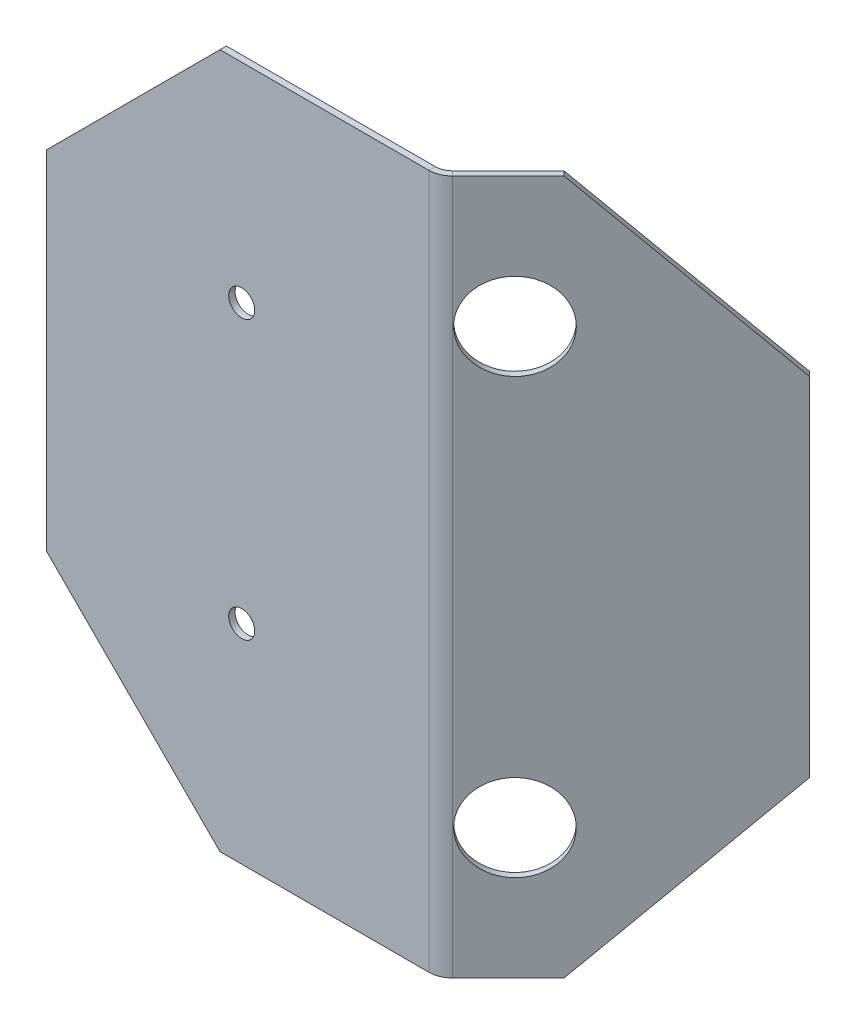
ISO-10303-21;
HEADER;
FILE_DESCRIPTION(('STEP AP214'),'2;1');
FILE_NAME('part.step','',(''),(''),'','','');
FILE_SCHEMA(('AUTOMOTIVE_DESIGN { 1 0 10303 214 1 1 1 1 }'));
ENDSEC;
DATA;
#1=APPLICATION_CONTEXT('core data for automotive mechanical design processes');
#2=APPLICATION_PROTOCOL_DEFINITION('international standard','automotive_design',2000,#1);
#3=PRODUCT_CONTEXT('',#1,'mechanical');
#4=PRODUCT('Part','Part','',(#3));
#5=PRODUCT_RELATED_PRODUCT_CATEGORY('part','',(#4));
#6=PRODUCT_DEFINITION_FORMATION('','',#4);
#7=PRODUCT_DEFINITION_CONTEXT('part definition',#1,'design');
#8=PRODUCT_DEFINITION('design','',#6,#7);
#9=PRODUCT_DEFINITION_SHAPE('','',#8);
#10=(LENGTH_UNIT() NAMED_UNIT(*) SI_UNIT(.MILLI.,.METRE.));
#11=(NAMED_UNIT(*) PLANE_ANGLE_UNIT() SI_UNIT($,.RADIAN.));
#12=(NAMED_UNIT(*) SI_UNIT($,.STERADIAN.) SOLID_ANGLE_UNIT());
#13=UNCERTAINTY_MEASURE_WITH_UNIT(LENGTH_MEASURE(1.E-05),#10,'distance_accuracy_value','');
#14=(GEOMETRIC_REPRESENTATION_CONTEXT(3) GLOBAL_UNCERTAINTY_ASSIGNED_CONTEXT((#13)) GLOBAL_UNIT_ASSIGNED_CONTEXT((#10,
#11,#12)) REPRESENTATION_CONTEXT('',''));
#15=CARTESIAN_POINT('',(0.,0.,0.));
#16=DIRECTION('',(0.,0.,1.));
#17=DIRECTION('',(1.,0.,0.));
#18=AXIS2_PLACEMENT_3D('',#15,#16,#17);
#19=CARTESIAN_POINT('',(21.5606126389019,-40.,-20.6205050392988));
#20=DIRECTION('',(0.707106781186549,0.,0.707106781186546));
#21=DIRECTION('',(0.707106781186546,0.,-0.707106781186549));
#22=AXIS2_PLACEMENT_3D('',#19,#20,#21);
#23=PLANE('',#22);
#24=CARTESIAN_POINT('',(4.59004989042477,25.,-3.64994229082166));
#25=DIRECTION('',(0.707106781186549,0.,0.707106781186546));
#26=DIRECTION('',(0.707106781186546,0.,-0.707106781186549));
#27=AXIS2_PLACEMENT_3D('',#24,#25,#26);
#28=CIRCLE('',#27,5.);
#29=CARTESIAN_POINT('',(8.1255837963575,25.,-7.1854761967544));
#30=VERTEX_POINT('',#29);
#31=EDGE_CURVE('E178',#30,#30,#28,.T.);
#32=ORIENTED_EDGE('',*,*,#31,.F.);
#33=EDGE_LOOP('',(#32));
#34=FACE_BOUND('',#33,.T.);
#35=CARTESIAN_POINT('',(4.59004989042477,-25.,-3.64994229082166));
#36=DIRECTION('',(0.707106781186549,0.,0.707106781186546));
#37=DIRECTION('',(-0.707106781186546,0.,0.707106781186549));
#38=AXIS2_PLACEMENT_3D('',#35,#36,#37);
#39=CIRCLE('',#38,5.);
#40=CARTESIAN_POINT('',(1.05451598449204,-25.,-0.114408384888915));
#41=VERTEX_POINT('',#40);
#42=EDGE_CURVE('E172',#41,#41,#39,.T.);
#43=ORIENTED_EDGE('',*,*,#42,.F.);
#44=EDGE_LOOP('',(#43));
#45=FACE_BOUND('',#44,.T.);
#46=DIRECTION('',(-0.707106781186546,0.,0.707106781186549));
#47=VECTOR('',#46,1.);
#48=CARTESIAN_POINT('',(-17.3302603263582,40.,18.2703679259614));
#49=LINE('',#48,#47);
#50=CARTESIAN_POINT('',(7.41847701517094,40.,-6.47836941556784));
#51=VERTEX_POINT('',#50);
#52=CARTESIAN_POINT('',(1.00503918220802,40.,-0.0649315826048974));
#53=VERTEX_POINT('',#52);
#54=EDGE_CURVE('E49',#51,#53,#49,.T.);
#55=ORIENTED_EDGE('',*,*,#54,.T.);
#56=DIRECTION('',(0.,-1.,0.));
#57=VECTOR('',#56,1.);
#58=CARTESIAN_POINT('',(1.00503918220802,-40.,-0.0649315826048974));
#59=LINE('',#58,#57);
#60=CARTESIAN_POINT('',(1.00503918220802,-40.,-0.0649315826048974));
#61=VERTEX_POINT('',#60);
#62=EDGE_CURVE('E41',#53,#61,#59,.T.);
#63=ORIENTED_EDGE('',*,*,#62,.T.);
#64=DIRECTION('',(0.707106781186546,0.,-0.707106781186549));
#65=VECTOR('',#64,1.);
#66=CARTESIAN_POINT('',(-31.4723959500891,-40.,32.4125035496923));
#67=LINE('',#66,#65);
#68=CARTESIAN_POINT('',(7.41847701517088,-40.,-6.47836941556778));
#69=VERTEX_POINT('',#68);
#70=EDGE_CURVE('E57',#61,#69,#67,.T.);
#71=ORIENTED_EDGE('',*,*,#70,.T.);
#72=DIRECTION('',(-0.5,-0.707106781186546,0.500000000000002));
#73=VECTOR('',#72,1.);
#74=CARTESIAN_POINT('',(14.4895448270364,-30.,-13.5494372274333));
#75=LINE('',#74,#73);
#76=CARTESIAN_POINT('',(21.5606126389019,-20.,-20.6205050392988));
#77=VERTEX_POINT('',#76);
#78=EDGE_CURVE('E197',#69,#77,#75,.F.);
#79=ORIENTED_EDGE('',*,*,#78,.T.);
#80=DIRECTION('',(0.,1.,0.));
#81=VECTOR('',#80,1.);
#82=CARTESIAN_POINT('',(21.5606126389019,40.,-20.6205050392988));
#83=LINE('',#82,#81);
#84=CARTESIAN_POINT('',(21.5606126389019,19.9999999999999,-20.6205050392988));
#85=VERTEX_POINT('',#84);
#86=EDGE_CURVE('E185',#77,#85,#83,.T.);
#87=ORIENTED_EDGE('',*,*,#86,.T.);
#88=DIRECTION('',(0.499999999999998,-0.707106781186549,-0.5));
#89=VECTOR('',#88,1.);
#90=CARTESIAN_POINT('',(42.7738160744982,-10.0000000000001,-41.8337084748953));
#91=LINE('',#90,#89);
#92=EDGE_CURVE('E195',#85,#51,#91,.F.);
#93=ORIENTED_EDGE('',*,*,#92,.T.);
#94=EDGE_LOOP('',(#55,#63,#71,#79,#87,#93));
#95=FACE_BOUND('',#94,.T.);
#96=ADVANCED_FACE('F32',(#34,#45,#95),#23,.T.);
#97=CARTESIAN_POINT('',(21.0397577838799,-40.,-21.1413598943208));
#98=DIRECTION('',(0.707106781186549,0.,0.707106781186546));
#99=DIRECTION('',(0.707106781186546,0.,-0.707106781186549));
#100=AXIS2_PLACEMENT_3D('',#97,#98,#99);
#101=PLANE('',#100);
#102=DIRECTION('',(0.,-1.,0.));
#103=VECTOR('',#102,1.);
#104=CARTESIAN_POINT('',(0.484184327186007,-40.,-0.585786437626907));
#105=LINE('',#104,#103);
#106=CARTESIAN_POINT('',(0.484184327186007,40.,-0.585786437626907));
#107=VERTEX_POINT('',#106);
#108=CARTESIAN_POINT('',(0.484184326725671,-40.,-0.585786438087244));
#109=VERTEX_POINT('',#108);
#110=EDGE_CURVE('E207',#107,#109,#105,.T.);
#111=ORIENTED_EDGE('',*,*,#110,.F.);
#112=DIRECTION('',(-0.707106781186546,0.,0.707106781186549));
#113=VECTOR('',#112,1.);
#114=CARTESIAN_POINT('',(-17.8511151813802,40.,17.7495130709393));
#115=LINE('',#114,#113);
#116=CARTESIAN_POINT('',(6.89762216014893,40.,-6.99922427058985));
#117=VERTEX_POINT('',#116);
#118=EDGE_CURVE('E184',#117,#107,#115,.T.);
#119=ORIENTED_EDGE('',*,*,#118,.F.);
#120=DIRECTION('',(-0.499999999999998,0.707106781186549,0.5));
#121=VECTOR('',#120,1.);
#122=CARTESIAN_POINT('',(6.89762216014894,40.,-6.99922427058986));
#123=LINE('',#122,#121);
#124=CARTESIAN_POINT('',(21.0397577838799,19.9999999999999,-21.1413598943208));
#125=VERTEX_POINT('',#124);
#126=EDGE_CURVE('E190',#117,#125,#123,.F.);
#127=ORIENTED_EDGE('',*,*,#126,.T.);
#128=DIRECTION('',(0.,1.,0.));
#129=VECTOR('',#128,1.);
#130=CARTESIAN_POINT('',(21.0397577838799,40.,-21.1413598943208));
#131=LINE('',#130,#129);
#132=CARTESIAN_POINT('',(21.0397577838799,-20.,-21.1413598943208));
#133=VERTEX_POINT('',#132);
#134=EDGE_CURVE('E181',#133,#125,#131,.T.);
#135=ORIENTED_EDGE('',*,*,#134,.F.);
#136=DIRECTION('',(0.5,0.707106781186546,-0.500000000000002));
#137=VECTOR('',#136,1.);
#138=CARTESIAN_POINT('',(21.0397577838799,-20.,-21.1413598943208));
#139=LINE('',#138,#137);
#140=CARTESIAN_POINT('',(6.89762216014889,-40.,-6.99922427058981));
#141=VERTEX_POINT('',#140);
#142=EDGE_CURVE('E192',#133,#141,#139,.F.);
#143=ORIENTED_EDGE('',*,*,#142,.T.);
#144=DIRECTION('',(0.707106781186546,0.,-0.707106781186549));
#145=VECTOR('',#144,1.);
#146=CARTESIAN_POINT('',(-17.8511151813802,-40.,17.7495130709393));
#147=LINE('',#146,#145);
#148=EDGE_CURVE('E36',#109,#141,#147,.T.);
#149=ORIENTED_EDGE('',*,*,#148,.F.);
#150=EDGE_LOOP('',(#111,#119,#127,#135,#143,#149));
#151=FACE_BOUND('',#150,.T.);
#152=CARTESIAN_POINT('',(4.06919503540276,25.,-4.17079714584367));
#153=DIRECTION('',(0.707106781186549,0.,0.707106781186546));
#154=DIRECTION('',(0.707106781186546,0.,-0.707106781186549));
#155=AXIS2_PLACEMENT_3D('',#152,#153,#154);
#156=CIRCLE('',#155,5.);
#157=CARTESIAN_POINT('',(7.60472894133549,25.,-7.70633105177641));
#158=VERTEX_POINT('',#157);
#159=EDGE_CURVE('E175',#158,#158,#156,.T.);
#160=ORIENTED_EDGE('',*,*,#159,.T.);
#161=EDGE_LOOP('',(#160));
#162=FACE_BOUND('',#161,.T.);
#163=CARTESIAN_POINT('',(4.06919503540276,-25.,-4.17079714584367));
#164=DIRECTION('',(0.707106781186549,0.,0.707106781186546));
#165=DIRECTION('',(-0.707106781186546,0.,0.707106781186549));
#166=AXIS2_PLACEMENT_3D('',#163,#164,#165);
#167=CIRCLE('',#166,5.);
#168=CARTESIAN_POINT('',(0.533661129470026,-25.,-0.635263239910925));
#169=VERTEX_POINT('',#168);
#170=EDGE_CURVE('E169',#169,#169,#167,.T.);
#171=ORIENTED_EDGE('',*,*,#170,.T.);
#172=EDGE_LOOP('',(#171));
#173=FACE_BOUND('',#172,.T.);
#174=ADVANCED_FACE('F229',(#151,#162,#173),#101,.F.);
#175=CARTESIAN_POINT('',(21.5606126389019,40.,-20.6205050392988));
#176=DIRECTION('',(-0.707106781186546,0.,0.707106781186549));
#177=DIRECTION('',(0.707106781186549,0.,0.707106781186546));
#178=AXIS2_PLACEMENT_3D('',#175,#176,#177);
#179=PLANE('',#178);
#180=ORIENTED_EDGE('',*,*,#86,.F.);
#181=DIRECTION('',(-0.707106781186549,0.,-0.707106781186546));
#182=VECTOR('',#181,1.);
#183=CARTESIAN_POINT('',(21.5606126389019,-20.,-20.6205050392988));
#184=LINE('',#183,#182);
#185=EDGE_CURVE('E204',#77,#133,#184,.T.);
#186=ORIENTED_EDGE('',*,*,#185,.T.);
#187=ORIENTED_EDGE('',*,*,#134,.T.);
#188=DIRECTION('',(0.707106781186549,0.,0.707106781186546));
#189=VECTOR('',#188,1.);
#190=CARTESIAN_POINT('',(21.5606126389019,19.9999999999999,-20.6205050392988));
#191=LINE('',#190,#189);
#192=EDGE_CURVE('E202',#125,#85,#191,.T.);
#193=ORIENTED_EDGE('',*,*,#192,.T.);
#194=EDGE_LOOP('',(#180,#186,#187,#193));
#195=FACE_BOUND('',#194,.T.);
#196=ADVANCED_FACE('F226',(#195),#179,.F.);
#197=CARTESIAN_POINT('',(-17.3302603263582,40.,18.2703679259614));
#198=DIRECTION('',(0.,-1.,0.));
#199=DIRECTION('',(-0.707106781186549,0.,-0.707106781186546));
#200=AXIS2_PLACEMENT_3D('',#197,#198,#199);
#201=PLANE('',#200);
#202=DIRECTION('',(-0.707106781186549,0.,-0.707106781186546));
#203=VECTOR('',#202,1.);
#204=CARTESIAN_POINT('',(1.00503918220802,40.,-0.0649315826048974));
#205=LINE('',#204,#203);
#206=EDGE_CURVE('E12',#53,#107,#205,.T.);
#207=ORIENTED_EDGE('',*,*,#206,.F.);
#208=ORIENTED_EDGE('',*,*,#54,.F.);
#209=DIRECTION('',(-0.707106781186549,0.,-0.707106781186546));
#210=VECTOR('',#209,1.);
#211=CARTESIAN_POINT('',(7.41847701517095,40.,-6.47836941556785));
#212=LINE('',#211,#210);
#213=EDGE_CURVE('E199',#51,#117,#212,.T.);
#214=ORIENTED_EDGE('',*,*,#213,.T.);
#215=ORIENTED_EDGE('',*,*,#118,.T.);
#216=EDGE_LOOP('',(#207,#208,#214,#215));
#217=FACE_BOUND('',#216,.T.);
#218=ADVANCED_FACE('F34',(#217),#201,.F.);
#219=CARTESIAN_POINT('',(-17.3302603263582,-40.,18.2703679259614));
#220=DIRECTION('',(0.,1.,0.));
#221=DIRECTION('',(0.707106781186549,0.,0.707106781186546));
#222=AXIS2_PLACEMENT_3D('',#219,#220,#221);
#223=PLANE('',#222);
#224=DIRECTION('',(0.707106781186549,0.,0.707106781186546));
#225=VECTOR('',#224,1.);
#226=CARTESIAN_POINT('',(1.00503918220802,-40.,-0.0649315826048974));
#227=LINE('',#226,#225);
#228=EDGE_CURVE('E210',#109,#61,#227,.T.);
#229=ORIENTED_EDGE('',*,*,#228,.F.);
#230=ORIENTED_EDGE('',*,*,#148,.T.);
#231=DIRECTION('',(0.707106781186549,0.,0.707106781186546));
#232=VECTOR('',#231,1.);
#233=CARTESIAN_POINT('',(7.4184770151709,-40.,-6.4783694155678));
#234=LINE('',#233,#232);
#235=EDGE_CURVE('E188',#141,#69,#234,.T.);
#236=ORIENTED_EDGE('',*,*,#235,.T.);
#237=ORIENTED_EDGE('',*,*,#70,.F.);
#238=EDGE_LOOP('',(#229,#230,#236,#237));
#239=FACE_BOUND('',#238,.T.);
#240=ADVANCED_FACE('F219',(#239),#223,.F.);
#241=CARTESIAN_POINT('',(4.59004989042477,25.,-3.64994229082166));
#242=DIRECTION('',(-0.707106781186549,0.,-0.707106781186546));
#243=DIRECTION('',(-0.707106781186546,0.,0.707106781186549));
#244=AXIS2_PLACEMENT_3D('',#241,#242,#243);
#245=CYLINDRICAL_SURFACE('',#244,5.);
#246=ORIENTED_EDGE('',*,*,#31,.T.);
#247=EDGE_LOOP('',(#246));
#248=FACE_BOUND('',#247,.T.);
#249=ORIENTED_EDGE('',*,*,#159,.F.);
#250=EDGE_LOOP('',(#249));
#251=FACE_BOUND('',#250,.T.);
#252=ADVANCED_FACE('F318',(#248,#251),#245,.F.);
#253=CARTESIAN_POINT('',(4.59004989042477,-25.,-3.64994229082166));
#254=DIRECTION('',(-0.707106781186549,0.,-0.707106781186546));
#255=DIRECTION('',(-0.707106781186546,0.,0.707106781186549));
#256=AXIS2_PLACEMENT_3D('',#253,#254,#255);
#257=CYLINDRICAL_SURFACE('',#256,5.);
#258=ORIENTED_EDGE('',*,*,#42,.T.);
#259=EDGE_LOOP('',(#258));
#260=FACE_BOUND('',#259,.T.);
#261=ORIENTED_EDGE('',*,*,#170,.F.);
#262=EDGE_LOOP('',(#261));
#263=FACE_BOUND('',#262,.T.);
#264=ADVANCED_FACE('F324',(#260,#263),#257,.F.);
#265=CARTESIAN_POINT('',(21.5606126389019,-20.,-20.6205050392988));
#266=DIRECTION('',(-0.499999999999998,0.707106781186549,0.5));
#267=DIRECTION('',(-0.5,-0.707106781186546,0.500000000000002));
#268=AXIS2_PLACEMENT_3D('',#265,#266,#267);
#269=PLANE('',#268);
#270=ORIENTED_EDGE('',*,*,#78,.F.);
#271=ORIENTED_EDGE('',*,*,#235,.F.);
#272=ORIENTED_EDGE('',*,*,#142,.F.);
#273=ORIENTED_EDGE('',*,*,#185,.F.);
#274=EDGE_LOOP('',(#270,#271,#272,#273));
#275=FACE_BOUND('',#274,.T.);
#276=ADVANCED_FACE('F223',(#275),#269,.F.);
#277=CARTESIAN_POINT('',(7.41847701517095,40.,-6.47836941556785));
#278=DIRECTION('',(-0.5,-0.707106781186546,0.500000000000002));
#279=DIRECTION('',(0.499999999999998,-0.707106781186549,-0.5));
#280=AXIS2_PLACEMENT_3D('',#277,#278,#279);
#281=PLANE('',#280);
#282=ORIENTED_EDGE('',*,*,#92,.F.);
#283=ORIENTED_EDGE('',*,*,#192,.F.);
#284=ORIENTED_EDGE('',*,*,#126,.F.);
#285=ORIENTED_EDGE('',*,*,#213,.F.);
#286=EDGE_LOOP('',(#282,#283,#284,#285));
#287=FACE_BOUND('',#286,.T.);
#288=ADVANCED_FACE('F235',(#287),#281,.F.);
#289=CARTESIAN_POINT('',(-45.,20.,0.7366));
#290=DIRECTION('',(0.707106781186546,-0.707106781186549,0.));
#291=DIRECTION('',(0.707106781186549,0.707106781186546,0.));
#292=AXIS2_PLACEMENT_3D('',#289,#290,#291);
#293=PLANE('',#292);
#294=DIRECTION('',(0.707106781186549,0.707106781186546,0.));
#295=VECTOR('',#294,1.);
#296=CARTESIAN_POINT('',(-37.4999999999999,27.5000000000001,0.7366));
#297=LINE('',#296,#295);
#298=CARTESIAN_POINT('',(-24.9999999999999,40.,0.7366));
#299=VERTEX_POINT('',#298);
#300=CARTESIAN_POINT('',(-45.,20.,0.7366));
#301=VERTEX_POINT('',#300);
#302=EDGE_CURVE('E151',#299,#301,#297,.F.);
#303=ORIENTED_EDGE('',*,*,#302,.F.);
#304=DIRECTION('',(0.,0.,1.));
#305=VECTOR('',#304,1.);
#306=CARTESIAN_POINT('',(-24.9999999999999,40.,0.7366));
#307=LINE('',#306,#305);
#308=CARTESIAN_POINT('',(-24.9999999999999,40.,0.));
#309=VERTEX_POINT('',#308);
#310=EDGE_CURVE('E148',#309,#299,#307,.T.);
#311=ORIENTED_EDGE('',*,*,#310,.F.);
#312=DIRECTION('',(-0.707106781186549,-0.707106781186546,0.));
#313=VECTOR('',#312,1.);
#314=CARTESIAN_POINT('',(-45.,20.,0.));
#315=LINE('',#314,#313);
#316=CARTESIAN_POINT('',(-45.,20.,0.));
#317=VERTEX_POINT('',#316);
#318=EDGE_CURVE('E262',#317,#309,#315,.F.);
#319=ORIENTED_EDGE('',*,*,#318,.F.);
#320=DIRECTION('',(0.,0.,-1.));
#321=VECTOR('',#320,1.);
#322=CARTESIAN_POINT('',(-45.,20.,0.7366));
#323=LINE('',#322,#321);
#324=EDGE_CURVE('E280',#301,#317,#323,.T.);
#325=ORIENTED_EDGE('',*,*,#324,.F.);
#326=EDGE_LOOP('',(#303,#311,#319,#325));
#327=FACE_BOUND('',#326,.T.);
#328=ADVANCED_FACE('F298',(#327),#293,.F.);
#329=CARTESIAN_POINT('',(-45.,40.,0.7366));
#330=DIRECTION('',(1.,0.,0.));
#331=DIRECTION('',(0.,0.,-1.));
#332=AXIS2_PLACEMENT_3D('',#329,#330,#331);
#333=PLANE('',#332);
#334=DIRECTION('',(0.,-1.,0.));
#335=VECTOR('',#334,1.);
#336=CARTESIAN_POINT('',(-45.,40.,0.));
#337=LINE('',#336,#335);
#338=CARTESIAN_POINT('',(-45.,-19.9999999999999,0.));
#339=VERTEX_POINT('',#338);
#340=EDGE_CURVE('E159',#317,#339,#337,.T.);
#341=ORIENTED_EDGE('',*,*,#340,.T.);
#342=DIRECTION('',(0.,0.,1.));
#343=VECTOR('',#342,1.);
#344=CARTESIAN_POINT('',(-45.,-19.9999999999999,0.7366));
#345=LINE('',#344,#343);
#346=CARTESIAN_POINT('',(-45.,-19.9999999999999,0.7366));
#347=VERTEX_POINT('',#346);
#348=EDGE_CURVE('E163',#339,#347,#345,.T.);
#349=ORIENTED_EDGE('',*,*,#348,.T.);
#350=DIRECTION('',(0.,-1.,0.));
#351=VECTOR('',#350,1.);
#352=CARTESIAN_POINT('',(-45.,40.,0.7366));
#353=LINE('',#352,#351);
#354=EDGE_CURVE('E251',#301,#347,#353,.T.);
#355=ORIENTED_EDGE('',*,*,#354,.F.);
#356=ORIENTED_EDGE('',*,*,#324,.T.);
#357=EDGE_LOOP('',(#341,#349,#355,#356));
#358=FACE_BOUND('',#357,.T.);
#359=ADVANCED_FACE('F285',(#358),#333,.F.);
#360=CARTESIAN_POINT('',(-25.,-40.,0.7366));
#361=DIRECTION('',(0.707106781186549,0.707106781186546,0.));
#362=DIRECTION('',(-0.707106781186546,0.707106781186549,0.));
#363=AXIS2_PLACEMENT_3D('',#360,#361,#362);
#364=PLANE('',#363);
#365=DIRECTION('',(-0.707106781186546,0.707106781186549,0.));
#366=VECTOR('',#365,1.);
#367=CARTESIAN_POINT('',(2.4999999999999,-67.5,0.7366));
#368=LINE('',#367,#366);
#369=CARTESIAN_POINT('',(-25.,-40.,0.7366));
#370=VERTEX_POINT('',#369);
#371=EDGE_CURVE('E249',#347,#370,#368,.F.);
#372=ORIENTED_EDGE('',*,*,#371,.F.);
#373=ORIENTED_EDGE('',*,*,#348,.F.);
#374=DIRECTION('',(0.707106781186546,-0.707106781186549,0.));
#375=VECTOR('',#374,1.);
#376=CARTESIAN_POINT('',(-25.,-40.,0.));
#377=LINE('',#376,#375);
#378=CARTESIAN_POINT('',(-25.,-40.,0.));
#379=VERTEX_POINT('',#378);
#380=EDGE_CURVE('E265',#379,#339,#377,.F.);
#381=ORIENTED_EDGE('',*,*,#380,.F.);
#382=DIRECTION('',(0.,0.,-1.));
#383=VECTOR('',#382,1.);
#384=CARTESIAN_POINT('',(-25.,-40.,0.7366));
#385=LINE('',#384,#383);
#386=EDGE_CURVE('E152',#370,#379,#385,.T.);
#387=ORIENTED_EDGE('',*,*,#386,.F.);
#388=EDGE_LOOP('',(#372,#373,#381,#387));
#389=FACE_BOUND('',#388,.T.);
#390=ADVANCED_FACE('F291',(#389),#364,.F.);
#391=CARTESIAN_POINT('',(-22.5,-16.,0.7366));
#392=DIRECTION('',(0.,0.,-1.));
#393=DIRECTION('',(-1.,0.,0.));
#394=AXIS2_PLACEMENT_3D('',#391,#392,#393);
#395=CYLINDRICAL_SURFACE('',#394,1.5);
#396=CARTESIAN_POINT('',(-22.5,-16.,0.7366));
#397=DIRECTION('',(0.,0.,1.));
#398=DIRECTION('',(-1.,0.,0.));
#399=AXIS2_PLACEMENT_3D('',#396,#397,#398);
#400=CIRCLE('',#399,1.5);
#401=CARTESIAN_POINT('',(-24.,-16.,0.7366));
#402=VERTEX_POINT('',#401);
#403=EDGE_CURVE('E277',#402,#402,#400,.T.);
#404=ORIENTED_EDGE('',*,*,#403,.T.);
#405=EDGE_LOOP('',(#404));
#406=FACE_BOUND('',#405,.T.);
#407=CARTESIAN_POINT('',(-22.5,-16.,0.));
#408=DIRECTION('',(0.,0.,1.));
#409=DIRECTION('',(-1.,0.,0.));
#410=AXIS2_PLACEMENT_3D('',#407,#408,#409);
#411=CIRCLE('',#410,1.5);
#412=CARTESIAN_POINT('',(-24.,-16.,0.));
#413=VERTEX_POINT('',#412);
#414=EDGE_CURVE('E268',#413,#413,#411,.T.);
#415=ORIENTED_EDGE('',*,*,#414,.F.);
#416=EDGE_LOOP('',(#415));
#417=FACE_BOUND('',#416,.T.);
#418=ADVANCED_FACE('F343',(#406,#417),#395,.F.);
#419=CARTESIAN_POINT('',(-22.5,16.,0.7366));
#420=DIRECTION('',(0.,0.,-1.));
#421=DIRECTION('',(-1.,0.,0.));
#422=AXIS2_PLACEMENT_3D('',#419,#420,#421);
#423=CYLINDRICAL_SURFACE('',#422,1.5);
#424=CARTESIAN_POINT('',(-22.5,16.,0.7366));
#425=DIRECTION('',(0.,0.,1.));
#426=DIRECTION('',(1.,0.,0.));
#427=AXIS2_PLACEMENT_3D('',#424,#425,#426);
#428=CIRCLE('',#427,1.5);
#429=CARTESIAN_POINT('',(-21.,16.,0.7366));
#430=VERTEX_POINT('',#429);
#431=EDGE_CURVE('E274',#430,#430,#428,.T.);
#432=ORIENTED_EDGE('',*,*,#431,.T.);
#433=EDGE_LOOP('',(#432));
#434=FACE_BOUND('',#433,.T.);
#435=CARTESIAN_POINT('',(-22.5,16.,0.));
#436=DIRECTION('',(0.,0.,1.));
#437=DIRECTION('',(1.,0.,0.));
#438=AXIS2_PLACEMENT_3D('',#435,#436,#437);
#439=CIRCLE('',#438,1.5);
#440=CARTESIAN_POINT('',(-21.,16.,0.));
#441=VERTEX_POINT('',#440);
#442=EDGE_CURVE('E271',#441,#441,#439,.T.);
#443=ORIENTED_EDGE('',*,*,#442,.F.);
#444=EDGE_LOOP('',(#443));
#445=FACE_BOUND('',#444,.T.);
#446=ADVANCED_FACE('F339',(#434,#445),#423,.F.);
#447=CARTESIAN_POINT('',(30.,-40.,0.));
#448=DIRECTION('',(0.,0.,1.));
#449=DIRECTION('',(1.,0.,0.));
#450=AXIS2_PLACEMENT_3D('',#447,#448,#449);
#451=PLANE('',#450);
#452=ORIENTED_EDGE('',*,*,#442,.T.);
#453=EDGE_LOOP('',(#452));
#454=FACE_BOUND('',#453,.T.);
#455=ORIENTED_EDGE('',*,*,#414,.T.);
#456=EDGE_LOOP('',(#455));
#457=FACE_BOUND('',#456,.T.);
#458=DIRECTION('',(-1.,0.,0.));
#459=VECTOR('',#458,1.);
#460=CARTESIAN_POINT('',(-25.,40.,0.));
#461=LINE('',#460,#459);
#462=CARTESIAN_POINT('',(-0.930029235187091,40.,-5.55675297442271E-10));
#463=VERTEX_POINT('',#462);
#464=EDGE_CURVE('E132',#463,#309,#461,.T.);
#465=ORIENTED_EDGE('',*,*,#464,.F.);
#466=DIRECTION('',(0.,-1.,0.));
#467=VECTOR('',#466,1.);
#468=CARTESIAN_POINT('',(-0.930029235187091,-40.,0.));
#469=LINE('',#468,#467);
#470=CARTESIAN_POINT('',(-0.930029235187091,-40.,-5.55675297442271E-10));
#471=VERTEX_POINT('',#470);
#472=EDGE_CURVE('E241',#463,#471,#469,.T.);
#473=ORIENTED_EDGE('',*,*,#472,.T.);
#474=DIRECTION('',(1.,0.,0.));
#475=VECTOR('',#474,1.);
#476=CARTESIAN_POINT('',(-25.,-40.,0.));
#477=LINE('',#476,#475);
#478=EDGE_CURVE('E259',#379,#471,#477,.T.);
#479=ORIENTED_EDGE('',*,*,#478,.F.);
#480=ORIENTED_EDGE('',*,*,#380,.T.);
#481=ORIENTED_EDGE('',*,*,#340,.F.);
#482=ORIENTED_EDGE('',*,*,#318,.T.);
#483=EDGE_LOOP('',(#465,#473,#479,#480,#481,#482));
#484=FACE_BOUND('',#483,.T.);
#485=ADVANCED_FACE('F296',(#454,#457,#484),#451,.F.);
#486=CARTESIAN_POINT('',(-25.,-40.,0.7366));
#487=DIRECTION('',(0.,1.,0.));
#488=DIRECTION('',(0.,0.,1.));
#489=AXIS2_PLACEMENT_3D('',#486,#487,#488);
#490=PLANE('',#489);
#491=ORIENTED_EDGE('',*,*,#478,.T.);
#492=DIRECTION('',(0.,0.,1.));
#493=VECTOR('',#492,1.);
#494=CARTESIAN_POINT('',(-0.930029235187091,-40.,0.7366));
#495=LINE('',#494,#493);
#496=CARTESIAN_POINT('',(-0.930029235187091,-40.,0.7366));
#497=VERTEX_POINT('',#496);
#498=EDGE_CURVE('E257',#471,#497,#495,.T.);
#499=ORIENTED_EDGE('',*,*,#498,.T.);
#500=DIRECTION('',(1.,0.,0.));
#501=VECTOR('',#500,1.);
#502=CARTESIAN_POINT('',(-45.,-40.,0.7366));
#503=LINE('',#502,#501);
#504=EDGE_CURVE('E133',#370,#497,#503,.T.);
#505=ORIENTED_EDGE('',*,*,#504,.F.);
#506=ORIENTED_EDGE('',*,*,#386,.T.);
#507=EDGE_LOOP('',(#491,#499,#505,#506));
#508=FACE_BOUND('',#507,.T.);
#509=ADVANCED_FACE('F294',(#508),#490,.F.);
#510=CARTESIAN_POINT('',(30.,-40.,0.7366));
#511=DIRECTION('',(0.,0.,1.));
#512=DIRECTION('',(1.,0.,0.));
#513=AXIS2_PLACEMENT_3D('',#510,#511,#512);
#514=PLANE('',#513);
#515=DIRECTION('',(0.,-1.,0.));
#516=VECTOR('',#515,1.);
#517=CARTESIAN_POINT('',(-0.930029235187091,-40.,0.7366));
#518=LINE('',#517,#516);
#519=CARTESIAN_POINT('',(-0.930029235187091,40.,0.736599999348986));
#520=VERTEX_POINT('',#519);
#521=EDGE_CURVE('E140',#520,#497,#518,.T.);
#522=ORIENTED_EDGE('',*,*,#521,.F.);
#523=DIRECTION('',(-1.,0.,0.));
#524=VECTOR('',#523,1.);
#525=CARTESIAN_POINT('',(-25.,40.,0.7366));
#526=LINE('',#525,#524);
#527=EDGE_CURVE('E145',#520,#299,#526,.T.);
#528=ORIENTED_EDGE('',*,*,#527,.T.);
#529=ORIENTED_EDGE('',*,*,#302,.T.);
#530=ORIENTED_EDGE('',*,*,#354,.T.);
#531=ORIENTED_EDGE('',*,*,#371,.T.);
#532=ORIENTED_EDGE('',*,*,#504,.T.);
#533=EDGE_LOOP('',(#522,#528,#529,#530,#531,#532));
#534=FACE_BOUND('',#533,.T.);
#535=ORIENTED_EDGE('',*,*,#403,.F.);
#536=EDGE_LOOP('',(#535));
#537=FACE_BOUND('',#536,.T.);
#538=ORIENTED_EDGE('',*,*,#431,.F.);
#539=EDGE_LOOP('',(#538));
#540=FACE_BOUND('',#539,.T.);
#541=ADVANCED_FACE('F155',(#534,#537,#540),#514,.T.);
#542=CARTESIAN_POINT('',(-25.,40.,0.7366));
#543=DIRECTION('',(0.,-1.,0.));
#544=DIRECTION('',(0.,0.,-1.));
#545=AXIS2_PLACEMENT_3D('',#542,#543,#544);
#546=PLANE('',#545);
#547=ORIENTED_EDGE('',*,*,#527,.F.);
#548=DIRECTION('',(0.,0.,-1.));
#549=VECTOR('',#548,1.);
#550=CARTESIAN_POINT('',(-0.930029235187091,40.,0.7366));
#551=LINE('',#550,#549);
#552=EDGE_CURVE('E123',#520,#463,#551,.T.);
#553=ORIENTED_EDGE('',*,*,#552,.T.);
#554=ORIENTED_EDGE('',*,*,#464,.T.);
#555=ORIENTED_EDGE('',*,*,#310,.T.);
#556=EDGE_LOOP('',(#547,#553,#554,#555));
#557=FACE_BOUND('',#556,.T.);
#558=ADVANCED_FACE('F146',(#557),#546,.F.);
#559=CARTESIAN_POINT('',(-0.930029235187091,40.,-1.99999999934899));
#560=DIRECTION('',(0.,-1.,0.));
#561=DIRECTION('',(0.,0.,-1.));
#562=AXIS2_PLACEMENT_3D('',#559,#560,#561);
#563=PLANE('',#562);
#564=ORIENTED_EDGE('',*,*,#552,.F.);
#565=CARTESIAN_POINT('',(-0.930029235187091,40.,-2.));
#566=DIRECTION('',(0.,-1.,0.));
#567=DIRECTION('',(0.,0.,-1.));
#568=AXIS2_PLACEMENT_3D('',#565,#566,#567);
#569=CIRCLE('',#568,2.73659999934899);
#570=EDGE_CURVE('E126',#520,#53,#569,.F.);
#571=ORIENTED_EDGE('',*,*,#570,.T.);
#572=ORIENTED_EDGE('',*,*,#206,.T.);
#573=CARTESIAN_POINT('',(-0.930029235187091,40.,-1.99999999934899));
#574=DIRECTION('',(0.,1.,0.));
#575=DIRECTION('',(0.,0.,-1.));
#576=AXIS2_PLACEMENT_3D('',#573,#574,#575);
#577=CIRCLE('',#576,1.99999999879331);
#578=EDGE_CURVE('E128',#463,#107,#577,.T.);
#579=ORIENTED_EDGE('',*,*,#578,.F.);
#580=EDGE_LOOP('',(#564,#571,#572,#579));
#581=FACE_BOUND('',#580,.T.);
#582=ADVANCED_FACE('F125',(#581),#563,.F.);
#583=CARTESIAN_POINT('',(-0.930029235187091,-40.,-1.99999999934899));
#584=DIRECTION('',(0.,1.,0.));
#585=DIRECTION('',(0.,0.,1.));
#586=AXIS2_PLACEMENT_3D('',#583,#584,#585);
#587=PLANE('',#586);
#588=ORIENTED_EDGE('',*,*,#228,.T.);
#589=CARTESIAN_POINT('',(-0.930029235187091,-40.,-2.));
#590=DIRECTION('',(0.,-1.,0.));
#591=DIRECTION('',(0.,0.,-1.));
#592=AXIS2_PLACEMENT_3D('',#589,#590,#591);
#593=CIRCLE('',#592,2.73659999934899);
#594=EDGE_CURVE('E142',#61,#497,#593,.T.);
#595=ORIENTED_EDGE('',*,*,#594,.T.);
#596=ORIENTED_EDGE('',*,*,#498,.F.);
#597=CARTESIAN_POINT('',(-0.930029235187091,-40.,-1.99999999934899));
#598=DIRECTION('',(0.,-1.,0.));
#599=DIRECTION('',(0.,0.,1.));
#600=AXIS2_PLACEMENT_3D('',#597,#598,#599);
#601=CIRCLE('',#600,1.99999999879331);
#602=EDGE_CURVE('E160',#109,#471,#601,.T.);
#603=ORIENTED_EDGE('',*,*,#602,.F.);
#604=EDGE_LOOP('',(#588,#595,#596,#603));
#605=FACE_BOUND('',#604,.T.);
#606=ADVANCED_FACE('F388',(#605),#587,.F.);
#607=CARTESIAN_POINT('',(-0.930029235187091,80.0250110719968,-2.));
#608=DIRECTION('',(0.,-1.,0.));
#609=DIRECTION('',(0.,0.,-1.));
#610=AXIS2_PLACEMENT_3D('',#607,#608,#609);
#611=CYLINDRICAL_SURFACE('',#610,1.99999999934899);
#612=ORIENTED_EDGE('',*,*,#602,.T.);
#613=ORIENTED_EDGE('',*,*,#472,.F.);
#614=ORIENTED_EDGE('',*,*,#578,.T.);
#615=ORIENTED_EDGE('',*,*,#110,.T.);
#616=EDGE_LOOP('',(#612,#613,#614,#615));
#617=FACE_BOUND('',#616,.T.);
#618=ADVANCED_FACE('F238',(#617),#611,.F.);
#619=CARTESIAN_POINT('',(-0.930029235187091,80.0250110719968,-2.));
#620=DIRECTION('',(0.,-1.,0.));
#621=DIRECTION('',(0.,0.,-1.));
#622=AXIS2_PLACEMENT_3D('',#619,#620,#621);
#623=CYLINDRICAL_SURFACE('',#622,2.73659999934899);
#624=ORIENTED_EDGE('',*,*,#594,.F.);
#625=ORIENTED_EDGE('',*,*,#62,.F.);
#626=ORIENTED_EDGE('',*,*,#570,.F.);
#627=ORIENTED_EDGE('',*,*,#521,.T.);
#628=EDGE_LOOP('',(#624,#625,#626,#627));
#629=FACE_BOUND('',#628,.T.);
#630=ADVANCED_FACE('F138',(#629),#623,.T.);
#631=CLOSED_SHELL('',(#96,#174,#196,#218,#240,#252,#264,#276,#288,#328,#359,#390,#418,#446,#485,
#509,#541,#558,#582,#606,#618,#630));
#632=MANIFOLD_SOLID_BREP('B2',#631);
#633=ADVANCED_BREP_SHAPE_REPRESENTATION('',(#18,#632),#14);
#634=SHAPE_DEFINITION_REPRESENTATION(#9,#633);
ENDSEC;
END-ISO-10303-21;
